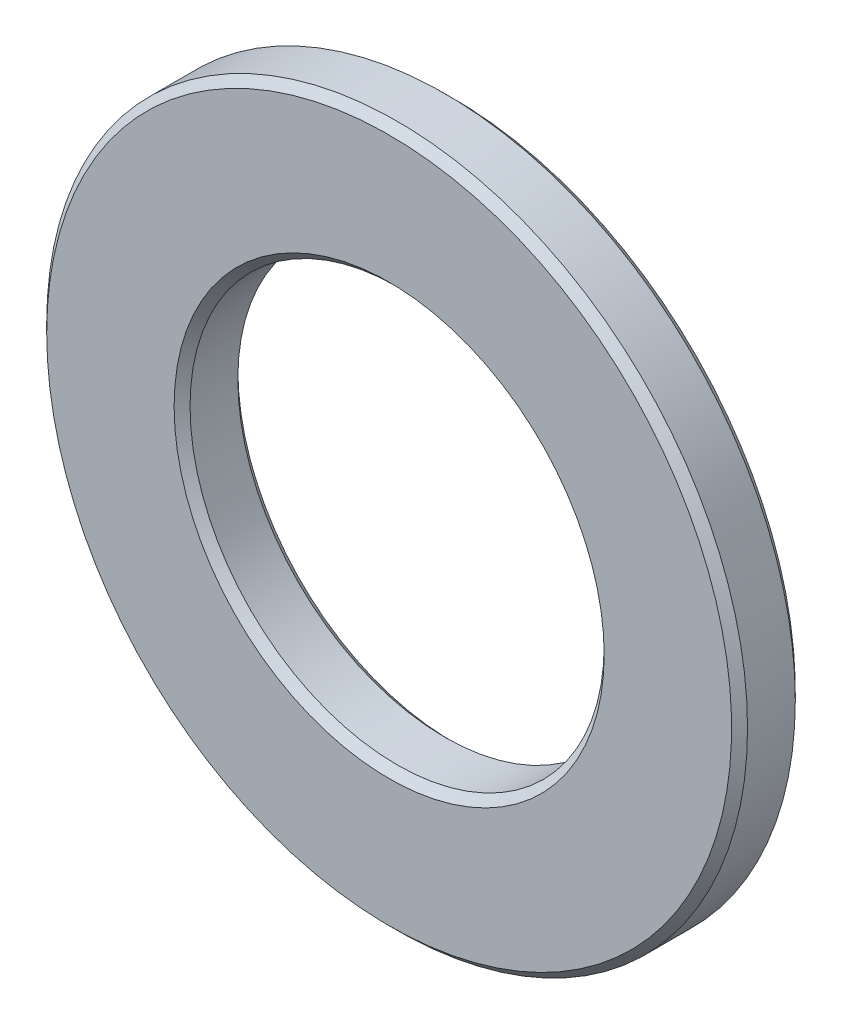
from build123d import *


with BuildPart() as part:
    # Sketch1 → Revolve1 (revolve)
    with BuildSketch(Plane(origin=(0, 0, 0), x_dir=(1, 0, 0), z_dir=(0, 1, 0)), mode=Mode.PRIVATE) as revolve1_sk:
        Polygon((0, 4), (21.5, 4), (22, 3.5), (22, 0.5), (21.5, 0), (0, 0), align=None)
    revolve(revolve1_sk.sketch.rotate(Axis((0, 0, 0), (0, 0, -1)), 180), axis=Axis((0, 0, 0), (0, 0, -1)))

    # Sketch2 → Cut-Revolve1 (revolve, cut)
    with BuildSketch(Plane(origin=(0, 0, 0), x_dir=(1, 0, 0), z_dir=(0, 1, 0)), mode=Mode.PRIVATE) as cut_revolve1_sk:
        Polygon((0, 4), (13.5, 4), (13, 3.5), (13, 0.5), (13.5, 0), (0, 0), align=None)
    revolve(cut_revolve1_sk.sketch.rotate(Axis((0, 0, 0), (0, 0, -1)), 180), axis=Axis((0, 0, 0), (0, 0, -1)), mode=Mode.SUBTRACT)


solid = part.part
